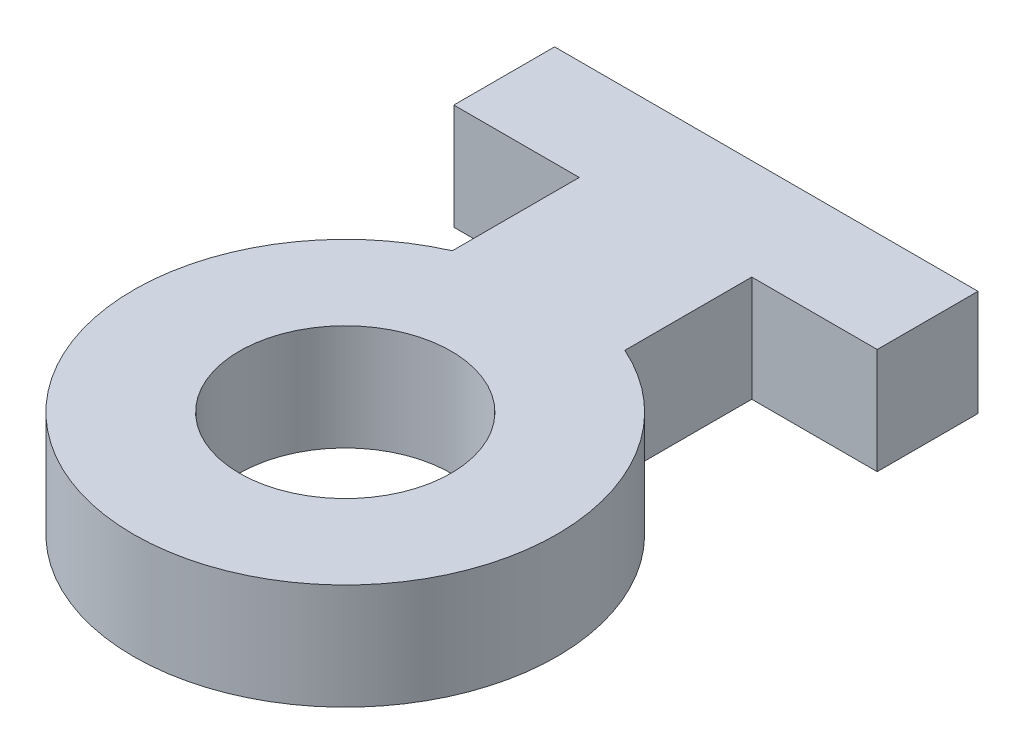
ISO-10303-21;
HEADER;
FILE_DESCRIPTION(('STEP AP214'),'2;1');
FILE_NAME('part.step','',(''),(''),'','','');
FILE_SCHEMA(('AUTOMOTIVE_DESIGN { 1 0 10303 214 1 1 1 1 }'));
ENDSEC;
DATA;
#1=APPLICATION_CONTEXT('core data for automotive mechanical design processes');
#2=APPLICATION_PROTOCOL_DEFINITION('international standard','automotive_design',2000,#1);
#3=PRODUCT_CONTEXT('',#1,'mechanical');
#4=PRODUCT('Part','Part','',(#3));
#5=PRODUCT_RELATED_PRODUCT_CATEGORY('part','',(#4));
#6=PRODUCT_DEFINITION_FORMATION('','',#4);
#7=PRODUCT_DEFINITION_CONTEXT('part definition',#1,'design');
#8=PRODUCT_DEFINITION('design','',#6,#7);
#9=PRODUCT_DEFINITION_SHAPE('','',#8);
#10=(LENGTH_UNIT() NAMED_UNIT(*) SI_UNIT(.MILLI.,.METRE.));
#11=(NAMED_UNIT(*) PLANE_ANGLE_UNIT() SI_UNIT($,.RADIAN.));
#12=(NAMED_UNIT(*) SI_UNIT($,.STERADIAN.) SOLID_ANGLE_UNIT());
#13=UNCERTAINTY_MEASURE_WITH_UNIT(LENGTH_MEASURE(1.E-05),#10,'distance_accuracy_value','');
#14=(GEOMETRIC_REPRESENTATION_CONTEXT(3) GLOBAL_UNCERTAINTY_ASSIGNED_CONTEXT((#13)) GLOBAL_UNIT_ASSIGNED_CONTEXT((#10,
#11,#12)) REPRESENTATION_CONTEXT('',''));
#15=CARTESIAN_POINT('',(0.,0.,0.));
#16=DIRECTION('',(0.,0.,1.));
#17=DIRECTION('',(1.,0.,0.));
#18=AXIS2_PLACEMENT_3D('',#15,#16,#17);
#19=CARTESIAN_POINT('',(0.,3.175,0.));
#20=DIRECTION('',(0.,1.,0.));
#21=DIRECTION('',(0.,0.,1.));
#22=AXIS2_PLACEMENT_3D('',#19,#20,#21);
#23=PLANE('',#22);
#24=CARTESIAN_POINT('',(0.,3.175,0.));
#25=DIRECTION('',(0.,1.,0.));
#26=DIRECTION('',(0.,0.,1.));
#27=AXIS2_PLACEMENT_3D('',#24,#25,#26);
#28=CIRCLE('',#27,6.35);
#29=CARTESIAN_POINT('',(-2.5872667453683,3.175,-5.7990129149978));
#30=VERTEX_POINT('',#29);
#31=CARTESIAN_POINT('',(2.5872667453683,3.175,-5.7990129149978));
#32=VERTEX_POINT('',#31);
#33=EDGE_CURVE('E145',#30,#32,#28,.T.);
#34=ORIENTED_EDGE('',*,*,#33,.T.);
#35=DIRECTION('',(0.,0.,-1.));
#36=VECTOR('',#35,1.);
#37=CARTESIAN_POINT('',(2.5872667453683,3.175,-9.6064577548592));
#38=LINE('',#37,#36);
#39=CARTESIAN_POINT('',(2.5872667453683,3.175,-9.6064577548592));
#40=VERTEX_POINT('',#39);
#41=EDGE_CURVE('E93',#32,#40,#38,.T.);
#42=ORIENTED_EDGE('',*,*,#41,.T.);
#43=DIRECTION('',(1.,0.,0.));
#44=VECTOR('',#43,1.);
#45=CARTESIAN_POINT('',(2.5872667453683,3.175,-9.6064577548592));
#46=LINE('',#45,#44);
#47=CARTESIAN_POINT('',(6.35,3.175,-9.6064577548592));
#48=VERTEX_POINT('',#47);
#49=EDGE_CURVE('E160',#40,#48,#46,.T.);
#50=ORIENTED_EDGE('',*,*,#49,.T.);
#51=DIRECTION('',(0.,0.,-1.));
#52=VECTOR('',#51,1.);
#53=CARTESIAN_POINT('',(6.35,3.175,-12.6296691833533));
#54=LINE('',#53,#52);
#55=CARTESIAN_POINT('',(6.35,3.175,-12.6296691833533));
#56=VERTEX_POINT('',#55);
#57=EDGE_CURVE('E173',#48,#56,#54,.T.);
#58=ORIENTED_EDGE('',*,*,#57,.T.);
#59=DIRECTION('',(-1.,0.,0.));
#60=VECTOR('',#59,1.);
#61=CARTESIAN_POINT('',(-6.35,3.175,-12.6296691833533));
#62=LINE('',#61,#60);
#63=CARTESIAN_POINT('',(-6.35,3.175,-12.6296691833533));
#64=VERTEX_POINT('',#63);
#65=EDGE_CURVE('E112',#56,#64,#62,.T.);
#66=ORIENTED_EDGE('',*,*,#65,.T.);
#67=DIRECTION('',(0.,0.,1.));
#68=VECTOR('',#67,1.);
#69=CARTESIAN_POINT('',(-6.35,3.175,-12.6296691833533));
#70=LINE('',#69,#68);
#71=CARTESIAN_POINT('',(-6.35,3.175,-9.6064577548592));
#72=VERTEX_POINT('',#71);
#73=EDGE_CURVE('E106',#64,#72,#70,.T.);
#74=ORIENTED_EDGE('',*,*,#73,.T.);
#75=DIRECTION('',(1.,0.,0.));
#76=VECTOR('',#75,1.);
#77=CARTESIAN_POINT('',(-6.35,3.175,-9.6064577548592));
#78=LINE('',#77,#76);
#79=CARTESIAN_POINT('',(-2.5872667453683,3.175,-9.6064577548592));
#80=VERTEX_POINT('',#79);
#81=EDGE_CURVE('E110',#72,#80,#78,.T.);
#82=ORIENTED_EDGE('',*,*,#81,.T.);
#83=DIRECTION('',(0.,0.,1.));
#84=VECTOR('',#83,1.);
#85=CARTESIAN_POINT('',(-2.5872667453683,3.175,-9.6064577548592));
#86=LINE('',#85,#84);
#87=EDGE_CURVE('E50',#80,#30,#86,.T.);
#88=ORIENTED_EDGE('',*,*,#87,.T.);
#89=EDGE_LOOP('',(#34,#42,#50,#58,#66,#74,#82,#88));
#90=FACE_BOUND('',#89,.T.);
#91=CARTESIAN_POINT('',(0.,3.175,0.));
#92=DIRECTION('',(0.,1.,0.));
#93=DIRECTION('',(0.,0.,1.));
#94=AXIS2_PLACEMENT_3D('',#91,#92,#93);
#95=CIRCLE('',#94,3.175);
#96=CARTESIAN_POINT('',(0.,3.175,3.175));
#97=VERTEX_POINT('',#96);
#98=EDGE_CURVE('E134',#97,#97,#95,.T.);
#99=ORIENTED_EDGE('',*,*,#98,.F.);
#100=EDGE_LOOP('',(#99));
#101=FACE_BOUND('',#100,.T.);
#102=ADVANCED_FACE('F33',(#90,#101),#23,.T.);
#103=CARTESIAN_POINT('',(0.,0.,0.));
#104=DIRECTION('',(0.,1.,0.));
#105=DIRECTION('',(0.,0.,1.));
#106=AXIS2_PLACEMENT_3D('',#103,#104,#105);
#107=PLANE('',#106);
#108=CARTESIAN_POINT('',(0.,0.,0.));
#109=DIRECTION('',(0.,1.,0.));
#110=DIRECTION('',(0.,0.,1.));
#111=AXIS2_PLACEMENT_3D('',#108,#109,#110);
#112=CIRCLE('',#111,6.35);
#113=CARTESIAN_POINT('',(-2.5872667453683,0.,-5.7990129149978));
#114=VERTEX_POINT('',#113);
#115=CARTESIAN_POINT('',(2.5872667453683,0.,-5.7990129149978));
#116=VERTEX_POINT('',#115);
#117=EDGE_CURVE('E130',#114,#116,#112,.T.);
#118=ORIENTED_EDGE('',*,*,#117,.F.);
#119=DIRECTION('',(0.,0.,1.));
#120=VECTOR('',#119,1.);
#121=CARTESIAN_POINT('',(-2.5872667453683,0.,-9.6064577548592));
#122=LINE('',#121,#120);
#123=CARTESIAN_POINT('',(-2.5872667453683,0.,-9.6064577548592));
#124=VERTEX_POINT('',#123);
#125=EDGE_CURVE('E85',#124,#114,#122,.T.);
#126=ORIENTED_EDGE('',*,*,#125,.F.);
#127=DIRECTION('',(1.,0.,0.));
#128=VECTOR('',#127,1.);
#129=CARTESIAN_POINT('',(-6.35,0.,-9.6064577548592));
#130=LINE('',#129,#128);
#131=CARTESIAN_POINT('',(-6.35,0.,-9.6064577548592));
#132=VERTEX_POINT('',#131);
#133=EDGE_CURVE('E79',#132,#124,#130,.T.);
#134=ORIENTED_EDGE('',*,*,#133,.F.);
#135=DIRECTION('',(0.,0.,1.));
#136=VECTOR('',#135,1.);
#137=CARTESIAN_POINT('',(-6.35,0.,-12.6296691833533));
#138=LINE('',#137,#136);
#139=CARTESIAN_POINT('',(-6.35,0.,-12.6296691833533));
#140=VERTEX_POINT('',#139);
#141=EDGE_CURVE('E120',#140,#132,#138,.T.);
#142=ORIENTED_EDGE('',*,*,#141,.F.);
#143=DIRECTION('',(-1.,0.,0.));
#144=VECTOR('',#143,1.);
#145=CARTESIAN_POINT('',(-6.35,0.,-12.6296691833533));
#146=LINE('',#145,#144);
#147=CARTESIAN_POINT('',(6.35,0.,-12.6296691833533));
#148=VERTEX_POINT('',#147);
#149=EDGE_CURVE('E140',#148,#140,#146,.T.);
#150=ORIENTED_EDGE('',*,*,#149,.F.);
#151=DIRECTION('',(0.,0.,-1.));
#152=VECTOR('',#151,1.);
#153=CARTESIAN_POINT('',(6.35,0.,-12.6296691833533));
#154=LINE('',#153,#152);
#155=CARTESIAN_POINT('',(6.35,0.,-9.6064577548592));
#156=VERTEX_POINT('',#155);
#157=EDGE_CURVE('E138',#156,#148,#154,.T.);
#158=ORIENTED_EDGE('',*,*,#157,.F.);
#159=DIRECTION('',(1.,0.,0.));
#160=VECTOR('',#159,1.);
#161=CARTESIAN_POINT('',(2.5872667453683,0.,-9.6064577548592));
#162=LINE('',#161,#160);
#163=CARTESIAN_POINT('',(2.5872667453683,0.,-9.6064577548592));
#164=VERTEX_POINT('',#163);
#165=EDGE_CURVE('E136',#164,#156,#162,.T.);
#166=ORIENTED_EDGE('',*,*,#165,.F.);
#167=DIRECTION('',(0.,0.,-1.));
#168=VECTOR('',#167,1.);
#169=CARTESIAN_POINT('',(2.5872667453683,0.,-9.6064577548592));
#170=LINE('',#169,#168);
#171=EDGE_CURVE('E133',#116,#164,#170,.T.);
#172=ORIENTED_EDGE('',*,*,#171,.F.);
#173=EDGE_LOOP('',(#118,#126,#134,#142,#150,#158,#166,#172));
#174=FACE_BOUND('',#173,.T.);
#175=CARTESIAN_POINT('',(0.,0.,0.));
#176=DIRECTION('',(0.,1.,0.));
#177=DIRECTION('',(0.,0.,1.));
#178=AXIS2_PLACEMENT_3D('',#175,#176,#177);
#179=CIRCLE('',#178,3.175);
#180=CARTESIAN_POINT('',(0.,0.,3.175));
#181=VERTEX_POINT('',#180);
#182=EDGE_CURVE('E179',#181,#181,#179,.T.);
#183=ORIENTED_EDGE('',*,*,#182,.T.);
#184=EDGE_LOOP('',(#183));
#185=FACE_BOUND('',#184,.T.);
#186=ADVANCED_FACE('F164',(#174,#185),#107,.F.);
#187=CARTESIAN_POINT('',(0.,3.175,0.));
#188=DIRECTION('',(0.,-1.,0.));
#189=DIRECTION('',(0.,0.,-1.));
#190=AXIS2_PLACEMENT_3D('',#187,#188,#189);
#191=CYLINDRICAL_SURFACE('',#190,6.35);
#192=ORIENTED_EDGE('',*,*,#117,.T.);
#193=DIRECTION('',(0.,-1.,0.));
#194=VECTOR('',#193,1.);
#195=CARTESIAN_POINT('',(2.5872667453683,3.175,-5.7990129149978));
#196=LINE('',#195,#194);
#197=EDGE_CURVE('E11',#32,#116,#196,.T.);
#198=ORIENTED_EDGE('',*,*,#197,.F.);
#199=ORIENTED_EDGE('',*,*,#33,.F.);
#200=DIRECTION('',(0.,-1.,0.));
#201=VECTOR('',#200,1.);
#202=CARTESIAN_POINT('',(-2.5872667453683,3.175,-5.7990129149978));
#203=LINE('',#202,#201);
#204=EDGE_CURVE('E126',#30,#114,#203,.T.);
#205=ORIENTED_EDGE('',*,*,#204,.T.);
#206=EDGE_LOOP('',(#192,#198,#199,#205));
#207=FACE_BOUND('',#206,.T.);
#208=ADVANCED_FACE('F35',(#207),#191,.T.);
#209=CARTESIAN_POINT('',(2.5872667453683,3.175,-9.6064577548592));
#210=DIRECTION('',(-1.,0.,0.));
#211=DIRECTION('',(0.,0.,1.));
#212=AXIS2_PLACEMENT_3D('',#209,#210,#211);
#213=PLANE('',#212);
#214=ORIENTED_EDGE('',*,*,#171,.T.);
#215=DIRECTION('',(0.,-1.,0.));
#216=VECTOR('',#215,1.);
#217=CARTESIAN_POINT('',(2.5872667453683,3.175,-9.6064577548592));
#218=LINE('',#217,#216);
#219=EDGE_CURVE('E42',#40,#164,#218,.T.);
#220=ORIENTED_EDGE('',*,*,#219,.F.);
#221=ORIENTED_EDGE('',*,*,#41,.F.);
#222=ORIENTED_EDGE('',*,*,#197,.T.);
#223=EDGE_LOOP('',(#214,#220,#221,#222));
#224=FACE_BOUND('',#223,.T.);
#225=ADVANCED_FACE('F207',(#224),#213,.F.);
#226=CARTESIAN_POINT('',(2.5872667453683,3.175,-9.6064577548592));
#227=DIRECTION('',(0.,0.,-1.));
#228=DIRECTION('',(-1.,0.,0.));
#229=AXIS2_PLACEMENT_3D('',#226,#227,#228);
#230=PLANE('',#229);
#231=ORIENTED_EDGE('',*,*,#165,.T.);
#232=DIRECTION('',(0.,-1.,0.));
#233=VECTOR('',#232,1.);
#234=CARTESIAN_POINT('',(6.35,3.175,-9.6064577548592));
#235=LINE('',#234,#233);
#236=EDGE_CURVE('E152',#48,#156,#235,.T.);
#237=ORIENTED_EDGE('',*,*,#236,.F.);
#238=ORIENTED_EDGE('',*,*,#49,.F.);
#239=ORIENTED_EDGE('',*,*,#219,.T.);
#240=EDGE_LOOP('',(#231,#237,#238,#239));
#241=FACE_BOUND('',#240,.T.);
#242=ADVANCED_FACE('F158',(#241),#230,.F.);
#243=CARTESIAN_POINT('',(6.35,3.175,-12.6296691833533));
#244=DIRECTION('',(-1.,0.,0.));
#245=DIRECTION('',(0.,0.,1.));
#246=AXIS2_PLACEMENT_3D('',#243,#244,#245);
#247=PLANE('',#246);
#248=ORIENTED_EDGE('',*,*,#157,.T.);
#249=DIRECTION('',(0.,-1.,0.));
#250=VECTOR('',#249,1.);
#251=CARTESIAN_POINT('',(6.35,3.175,-12.6296691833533));
#252=LINE('',#251,#250);
#253=EDGE_CURVE('E149',#56,#148,#252,.T.);
#254=ORIENTED_EDGE('',*,*,#253,.F.);
#255=ORIENTED_EDGE('',*,*,#57,.F.);
#256=ORIENTED_EDGE('',*,*,#236,.T.);
#257=EDGE_LOOP('',(#248,#254,#255,#256));
#258=FACE_BOUND('',#257,.T.);
#259=ADVANCED_FACE('F169',(#258),#247,.F.);
#260=CARTESIAN_POINT('',(-6.35,3.175,-12.6296691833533));
#261=DIRECTION('',(0.,0.,1.));
#262=DIRECTION('',(1.,0.,0.));
#263=AXIS2_PLACEMENT_3D('',#260,#261,#262);
#264=PLANE('',#263);
#265=ORIENTED_EDGE('',*,*,#149,.T.);
#266=DIRECTION('',(0.,-1.,0.));
#267=VECTOR('',#266,1.);
#268=CARTESIAN_POINT('',(-6.35,3.175,-12.6296691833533));
#269=LINE('',#268,#267);
#270=EDGE_CURVE('E121',#64,#140,#269,.T.);
#271=ORIENTED_EDGE('',*,*,#270,.F.);
#272=ORIENTED_EDGE('',*,*,#65,.F.);
#273=ORIENTED_EDGE('',*,*,#253,.T.);
#274=EDGE_LOOP('',(#265,#271,#272,#273));
#275=FACE_BOUND('',#274,.T.);
#276=ADVANCED_FACE('F172',(#275),#264,.F.);
#277=CARTESIAN_POINT('',(-6.35,3.175,-12.6296691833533));
#278=DIRECTION('',(1.,0.,0.));
#279=DIRECTION('',(0.,0.,-1.));
#280=AXIS2_PLACEMENT_3D('',#277,#278,#279);
#281=PLANE('',#280);
#282=ORIENTED_EDGE('',*,*,#141,.T.);
#283=DIRECTION('',(0.,-1.,0.));
#284=VECTOR('',#283,1.);
#285=CARTESIAN_POINT('',(-6.35,3.175,-9.6064577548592));
#286=LINE('',#285,#284);
#287=EDGE_CURVE('E117',#72,#132,#286,.T.);
#288=ORIENTED_EDGE('',*,*,#287,.F.);
#289=ORIENTED_EDGE('',*,*,#73,.F.);
#290=ORIENTED_EDGE('',*,*,#270,.T.);
#291=EDGE_LOOP('',(#282,#288,#289,#290));
#292=FACE_BOUND('',#291,.T.);
#293=ADVANCED_FACE('F118',(#292),#281,.F.);
#294=CARTESIAN_POINT('',(-6.35,3.175,-9.6064577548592));
#295=DIRECTION('',(0.,0.,-1.));
#296=DIRECTION('',(-1.,0.,0.));
#297=AXIS2_PLACEMENT_3D('',#294,#295,#296);
#298=PLANE('',#297);
#299=ORIENTED_EDGE('',*,*,#133,.T.);
#300=DIRECTION('',(0.,-1.,0.));
#301=VECTOR('',#300,1.);
#302=CARTESIAN_POINT('',(-2.5872667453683,3.175,-9.6064577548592));
#303=LINE('',#302,#301);
#304=EDGE_CURVE('E122',#80,#124,#303,.T.);
#305=ORIENTED_EDGE('',*,*,#304,.F.);
#306=ORIENTED_EDGE('',*,*,#81,.F.);
#307=ORIENTED_EDGE('',*,*,#287,.T.);
#308=EDGE_LOOP('',(#299,#305,#306,#307));
#309=FACE_BOUND('',#308,.T.);
#310=ADVANCED_FACE('F124',(#309),#298,.F.);
#311=CARTESIAN_POINT('',(-2.5872667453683,3.175,-9.6064577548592));
#312=DIRECTION('',(1.,0.,0.));
#313=DIRECTION('',(0.,0.,-1.));
#314=AXIS2_PLACEMENT_3D('',#311,#312,#313);
#315=PLANE('',#314);
#316=ORIENTED_EDGE('',*,*,#125,.T.);
#317=ORIENTED_EDGE('',*,*,#204,.F.);
#318=ORIENTED_EDGE('',*,*,#87,.F.);
#319=ORIENTED_EDGE('',*,*,#304,.T.);
#320=EDGE_LOOP('',(#316,#317,#318,#319));
#321=FACE_BOUND('',#320,.T.);
#322=ADVANCED_FACE('F195',(#321),#315,.F.);
#323=CARTESIAN_POINT('',(0.,3.175,0.));
#324=DIRECTION('',(0.,-1.,0.));
#325=DIRECTION('',(0.,0.,-1.));
#326=AXIS2_PLACEMENT_3D('',#323,#324,#325);
#327=CYLINDRICAL_SURFACE('',#326,3.175);
#328=ORIENTED_EDGE('',*,*,#98,.T.);
#329=EDGE_LOOP('',(#328));
#330=FACE_BOUND('',#329,.T.);
#331=ORIENTED_EDGE('',*,*,#182,.F.);
#332=EDGE_LOOP('',(#331));
#333=FACE_BOUND('',#332,.T.);
#334=ADVANCED_FACE('F185',(#330,#333),#327,.F.);
#335=CLOSED_SHELL('',(#102,#186,#208,#225,#242,#259,#276,#293,#310,#322,#334));
#336=MANIFOLD_SOLID_BREP('B2',#335);
#337=ADVANCED_BREP_SHAPE_REPRESENTATION('',(#18,#336),#14);
#338=SHAPE_DEFINITION_REPRESENTATION(#9,#337);
ENDSEC;
END-ISO-10303-21;
